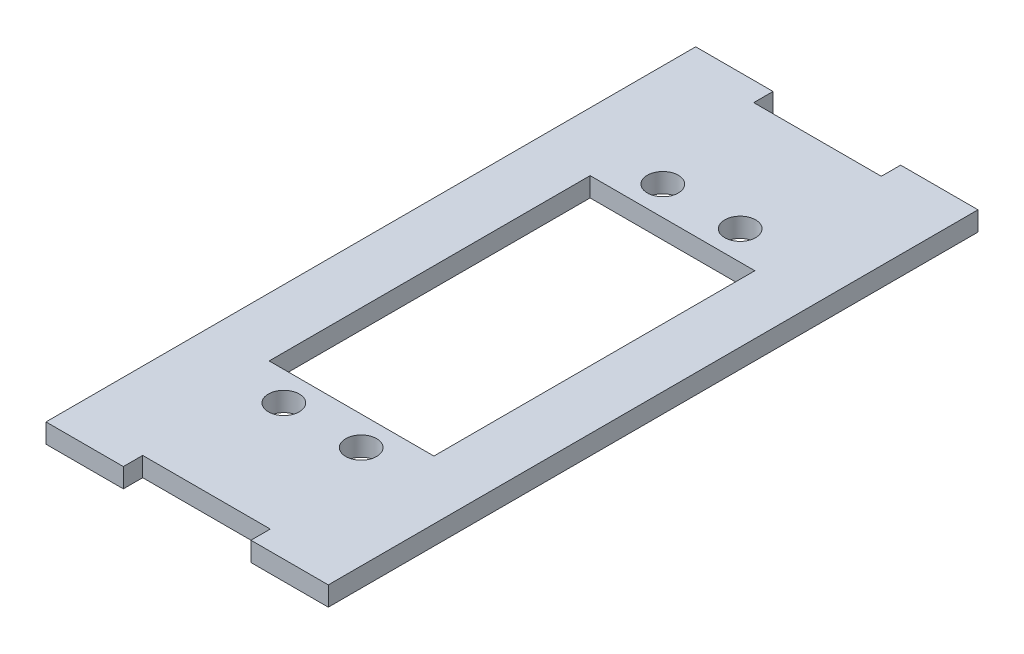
from build123d import *

# Parameters (mm, degrees)
SKETCH1_R           = 2
SKETCH1_W           = 21.298202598
SKETCH1_H           = 41.498202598
BOSS_EXTRUDE1_DEPTH = 2.5


with BuildPart() as part:
    # Sketch1 → Boss-Extrude1 (new body)
    with BuildSketch(Plane.XZ):
        Polygon((-18.249101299, 52), (-8.249101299, 52), (-8.249101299, 49.5), (8.249101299, 49.5), (8.249101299, 52), (18.249101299, 52), (18.249101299, -32), (8.249101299, -32), (8.249101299, -29.5), (-8.249101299, -29.5), (-8.249101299, -32), (-18.249101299, -32), align=None)
        with Locations(Location((5, -14.5, 0), (0, 0, 270))):
            Circle(SKETCH1_R, mode=Mode.SUBTRACT)
        with Locations(Location((-5, -14.5, 0), (0, 0, 270))):
            Circle(SKETCH1_R, mode=Mode.SUBTRACT)
        with Locations(Location((-5, 34.5, 0), (0, 0, 270))):
            Circle(SKETCH1_R, mode=Mode.SUBTRACT)
        with Locations(Location((5, 34.5, 0), (0, 0, 270))):
            Circle(SKETCH1_R, mode=Mode.SUBTRACT)
        with Locations((0, 10)):
            Rectangle(SKETCH1_W, SKETCH1_H, mode=Mode.SUBTRACT)
    extrude(amount=BOSS_EXTRUDE1_DEPTH)


solid = part.part
